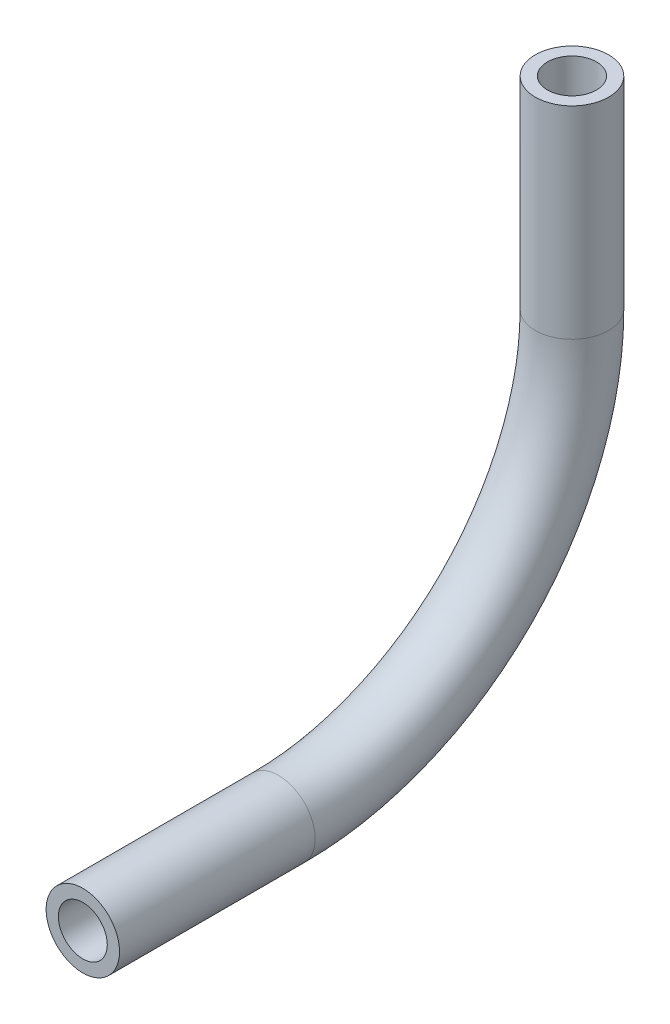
ISO-10303-21;
HEADER;
FILE_DESCRIPTION(('STEP AP214'),'2;1');
FILE_NAME('part.step','',(''),(''),'','','');
FILE_SCHEMA(('AUTOMOTIVE_DESIGN { 1 0 10303 214 1 1 1 1 }'));
ENDSEC;
DATA;
#1=APPLICATION_CONTEXT('core data for automotive mechanical design processes');
#2=APPLICATION_PROTOCOL_DEFINITION('international standard','automotive_design',2000,#1);
#3=PRODUCT_CONTEXT('',#1,'mechanical');
#4=PRODUCT('Part','Part','',(#3));
#5=PRODUCT_RELATED_PRODUCT_CATEGORY('part','',(#4));
#6=PRODUCT_DEFINITION_FORMATION('','',#4);
#7=PRODUCT_DEFINITION_CONTEXT('part definition',#1,'design');
#8=PRODUCT_DEFINITION('design','',#6,#7);
#9=PRODUCT_DEFINITION_SHAPE('','',#8);
#10=(LENGTH_UNIT() NAMED_UNIT(*) SI_UNIT(.MILLI.,.METRE.));
#11=(NAMED_UNIT(*) PLANE_ANGLE_UNIT() SI_UNIT($,.RADIAN.));
#12=(NAMED_UNIT(*) SI_UNIT($,.STERADIAN.) SOLID_ANGLE_UNIT());
#13=UNCERTAINTY_MEASURE_WITH_UNIT(LENGTH_MEASURE(1.E-05),#10,'distance_accuracy_value','');
#14=(GEOMETRIC_REPRESENTATION_CONTEXT(3) GLOBAL_UNCERTAINTY_ASSIGNED_CONTEXT((#13)) GLOBAL_UNIT_ASSIGNED_CONTEXT((#10,
#11,#12)) REPRESENTATION_CONTEXT('',''));
#15=CARTESIAN_POINT('',(0.,0.,0.));
#16=DIRECTION('',(0.,0.,1.));
#17=DIRECTION('',(1.,0.,0.));
#18=AXIS2_PLACEMENT_3D('',#15,#16,#17);
#19=CARTESIAN_POINT('',(0.,76.2,-127.));
#20=DIRECTION('',(0.,1.,0.));
#21=DIRECTION('',(0.,0.,1.));
#22=AXIS2_PLACEMENT_3D('',#19,#20,#21);
#23=CYLINDRICAL_SURFACE('',#22,9.525);
#24=CARTESIAN_POINT('',(0.,76.2,-127.));
#25=DIRECTION('',(0.,-1.,0.));
#26=DIRECTION('',(1.,0.,0.));
#27=AXIS2_PLACEMENT_3D('',#24,#25,#26);
#28=CIRCLE('',#27,9.525);
#29=CARTESIAN_POINT('',(0.,76.2,-136.525));
#30=VERTEX_POINT('',#29);
#31=EDGE_CURVE('E41',#30,#30,#28,.T.);
#32=ORIENTED_EDGE('',*,*,#31,.F.);
#33=EDGE_LOOP('',(#32));
#34=FACE_BOUND('',#33,.T.);
#35=CARTESIAN_POINT('',(0.,128.680239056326,-127.));
#36=DIRECTION('',(0.,-1.,0.));
#37=DIRECTION('',(1.,0.,0.));
#38=AXIS2_PLACEMENT_3D('',#35,#36,#37);
#39=CIRCLE('',#38,9.525);
#40=CARTESIAN_POINT('',(9.525,128.680239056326,-127.));
#41=VERTEX_POINT('',#40);
#42=EDGE_CURVE('E10',#41,#41,#39,.T.);
#43=ORIENTED_EDGE('',*,*,#42,.T.);
#44=EDGE_LOOP('',(#43));
#45=FACE_BOUND('',#44,.T.);
#46=ADVANCED_FACE('F31',(#34,#45),#23,.T.);
#47=CARTESIAN_POINT('',(0.,76.2,-127.));
#48=DIRECTION('',(0.,1.,0.));
#49=DIRECTION('',(0.,0.,1.));
#50=AXIS2_PLACEMENT_3D('',#47,#48,#49);
#51=CYLINDRICAL_SURFACE('',#50,6.35);
#52=CARTESIAN_POINT('',(0.,76.2,-127.));
#53=DIRECTION('',(0.,-1.,0.));
#54=DIRECTION('',(1.,0.,0.));
#55=AXIS2_PLACEMENT_3D('',#52,#53,#54);
#56=CIRCLE('',#55,6.35);
#57=CARTESIAN_POINT('',(0.,76.2,-133.35));
#58=VERTEX_POINT('',#57);
#59=EDGE_CURVE('E45',#58,#58,#56,.T.);
#60=ORIENTED_EDGE('',*,*,#59,.T.);
#61=EDGE_LOOP('',(#60));
#62=FACE_BOUND('',#61,.T.);
#63=CARTESIAN_POINT('',(0.,128.680239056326,-127.));
#64=DIRECTION('',(0.,-1.,0.));
#65=DIRECTION('',(1.,0.,0.));
#66=AXIS2_PLACEMENT_3D('',#63,#64,#65);
#67=CIRCLE('',#66,6.35);
#68=CARTESIAN_POINT('',(6.35,128.680239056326,-127.));
#69=VERTEX_POINT('',#68);
#70=EDGE_CURVE('E37',#69,#69,#67,.T.);
#71=ORIENTED_EDGE('',*,*,#70,.F.);
#72=EDGE_LOOP('',(#71));
#73=FACE_BOUND('',#72,.T.);
#74=ADVANCED_FACE('F88',(#62,#73),#51,.F.);
#75=CARTESIAN_POINT('',(0.,76.2,-50.8));
#76=DIRECTION('',(1.,0.,0.));
#77=DIRECTION('',(0.,0.,-1.));
#78=AXIS2_PLACEMENT_3D('',#75,#76,#77);
#79=TOROIDAL_SURFACE('',#78,76.2,9.525);
#80=CARTESIAN_POINT('',(0.,0.,-50.8));
#81=DIRECTION('',(0.,0.,1.));
#82=DIRECTION('',(1.,0.,0.));
#83=AXIS2_PLACEMENT_3D('',#80,#81,#82);
#84=CIRCLE('',#83,9.525);
#85=CARTESIAN_POINT('',(0.,-9.52499999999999,-50.8));
#86=VERTEX_POINT('',#85);
#87=EDGE_CURVE('E50',#86,#86,#84,.T.);
#88=CARTESIAN_POINT('',(0.,76.2,-50.8));
#89=DIRECTION('',(1.,0.,0.));
#90=DIRECTION('',(0.,0.,-1.));
#91=AXIS2_PLACEMENT_3D('',#88,#89,#90);
#92=CIRCLE('',#91,85.725);
#93=EDGE_CURVE('',#86,#30,#92,.T.);
#94=ORIENTED_EDGE('',*,*,#87,.F.);
#95=ORIENTED_EDGE('',*,*,#31,.T.);
#96=ORIENTED_EDGE('',*,*,#93,.T.);
#97=ORIENTED_EDGE('',*,*,#93,.F.);
#98=EDGE_LOOP('',(#94,#96,#95,#97));
#99=FACE_BOUND('',#98,.T.);
#100=ADVANCED_FACE('F93',(#99),#79,.T.);
#101=CARTESIAN_POINT('',(0.,76.2,-50.8));
#102=DIRECTION('',(1.,0.,0.));
#103=DIRECTION('',(0.,0.,-1.));
#104=AXIS2_PLACEMENT_3D('',#101,#102,#103);
#105=TOROIDAL_SURFACE('',#104,76.2,6.35);
#106=CARTESIAN_POINT('',(0.,0.,-50.8));
#107=DIRECTION('',(0.,0.,1.));
#108=DIRECTION('',(1.,0.,0.));
#109=AXIS2_PLACEMENT_3D('',#106,#107,#108);
#110=CIRCLE('',#109,6.35);
#111=CARTESIAN_POINT('',(0.,-6.34999999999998,-50.8));
#112=VERTEX_POINT('',#111);
#113=EDGE_CURVE('E54',#112,#112,#110,.T.);
#114=CARTESIAN_POINT('',(0.,76.2,-50.8));
#115=DIRECTION('',(1.,0.,0.));
#116=DIRECTION('',(0.,0.,-1.));
#117=AXIS2_PLACEMENT_3D('',#114,#115,#116);
#118=CIRCLE('',#117,82.55);
#119=EDGE_CURVE('',#112,#58,#118,.T.);
#120=ORIENTED_EDGE('',*,*,#113,.T.);
#121=ORIENTED_EDGE('',*,*,#59,.F.);
#122=ORIENTED_EDGE('',*,*,#119,.T.);
#123=ORIENTED_EDGE('',*,*,#119,.F.);
#124=EDGE_LOOP('',(#120,#122,#121,#123));
#125=FACE_BOUND('',#124,.T.);
#126=ADVANCED_FACE('F63',(#125),#105,.F.);
#127=CARTESIAN_POINT('',(0.,0.,-50.8));
#128=DIRECTION('',(0.,0.,1.));
#129=DIRECTION('',(1.,0.,0.));
#130=AXIS2_PLACEMENT_3D('',#127,#128,#129);
#131=CYLINDRICAL_SURFACE('',#130,6.35);
#132=ORIENTED_EDGE('',*,*,#113,.F.);
#133=EDGE_LOOP('',(#132));
#134=FACE_BOUND('',#133,.T.);
#135=CARTESIAN_POINT('',(0.,0.,0.));
#136=DIRECTION('',(0.,0.,1.));
#137=DIRECTION('',(1.,0.,0.));
#138=AXIS2_PLACEMENT_3D('',#135,#136,#137);
#139=CIRCLE('',#138,6.35);
#140=CARTESIAN_POINT('',(6.35,0.,0.));
#141=VERTEX_POINT('',#140);
#142=EDGE_CURVE('E55',#141,#141,#139,.T.);
#143=ORIENTED_EDGE('',*,*,#142,.T.);
#144=EDGE_LOOP('',(#143));
#145=FACE_BOUND('',#144,.T.);
#146=ADVANCED_FACE('F66',(#134,#145),#131,.F.);
#147=CARTESIAN_POINT('',(0.,0.,-50.8));
#148=DIRECTION('',(0.,0.,1.));
#149=DIRECTION('',(1.,0.,0.));
#150=AXIS2_PLACEMENT_3D('',#147,#148,#149);
#151=CYLINDRICAL_SURFACE('',#150,9.525);
#152=ORIENTED_EDGE('',*,*,#87,.T.);
#153=EDGE_LOOP('',(#152));
#154=FACE_BOUND('',#153,.T.);
#155=CARTESIAN_POINT('',(0.,0.,0.));
#156=DIRECTION('',(0.,0.,1.));
#157=DIRECTION('',(1.,0.,0.));
#158=AXIS2_PLACEMENT_3D('',#155,#156,#157);
#159=CIRCLE('',#158,9.525);
#160=CARTESIAN_POINT('',(9.525,0.,0.));
#161=VERTEX_POINT('',#160);
#162=EDGE_CURVE('E51',#161,#161,#159,.T.);
#163=ORIENTED_EDGE('',*,*,#162,.F.);
#164=EDGE_LOOP('',(#163));
#165=FACE_BOUND('',#164,.T.);
#166=ADVANCED_FACE('F69',(#154,#165),#151,.T.);
#167=CARTESIAN_POINT('',(0.,128.680239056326,-127.));
#168=DIRECTION('',(0.,-1.,0.));
#169=DIRECTION('',(1.,0.,0.));
#170=AXIS2_PLACEMENT_3D('',#167,#168,#169);
#171=PLANE('',#170);
#172=ORIENTED_EDGE('',*,*,#70,.T.);
#173=EDGE_LOOP('',(#172));
#174=FACE_BOUND('',#173,.T.);
#175=ORIENTED_EDGE('',*,*,#42,.F.);
#176=EDGE_LOOP('',(#175));
#177=FACE_BOUND('',#176,.T.);
#178=ADVANCED_FACE('F76',(#174,#177),#171,.F.);
#179=CARTESIAN_POINT('',(0.,0.,0.));
#180=DIRECTION('',(0.,0.,1.));
#181=DIRECTION('',(1.,0.,0.));
#182=AXIS2_PLACEMENT_3D('',#179,#180,#181);
#183=PLANE('',#182);
#184=ORIENTED_EDGE('',*,*,#142,.F.);
#185=EDGE_LOOP('',(#184));
#186=FACE_BOUND('',#185,.T.);
#187=ORIENTED_EDGE('',*,*,#162,.T.);
#188=EDGE_LOOP('',(#187));
#189=FACE_BOUND('',#188,.T.);
#190=ADVANCED_FACE('F73',(#186,#189),#183,.T.);
#191=CLOSED_SHELL('',(#46,#74,#100,#126,#146,#166,#178,#190));
#192=MANIFOLD_SOLID_BREP('B2',#191);
#193=ADVANCED_BREP_SHAPE_REPRESENTATION('',(#18,#192),#14);
#194=SHAPE_DEFINITION_REPRESENTATION(#9,#193);
ENDSEC;
END-ISO-10303-21;
